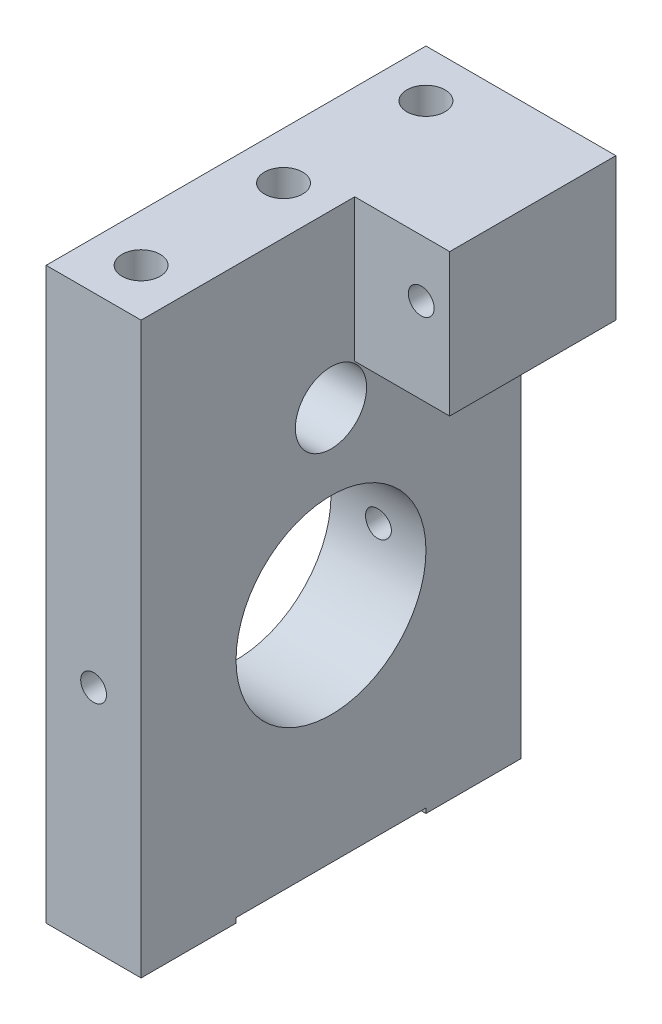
from build123d import *

# Parameters (mm, degrees)
SKETCH1_W                   = 50.8
SKETCH1_H                   = 76.2
BOSS_EXTRUDE1_DEPTH         = 6.35
SKETCH2_W                   = 22.225
SKETCH2_H                   = 19.05
BOSS_EXTRUDE2_DEPTH         = 12.7
F_1_4_20_TAPPED_HOLE1_D     = 5.1054
F_1_4_20_TAPPED_HOLE1_DEPTH = 19.05
F_1_4_20_TAPPED_HOLE1_TIP   = 1.533816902
CUT_EXTRUDE1_REACH          = 49.519
SKETCH5_W                   = 25.4
SKETCH5_H                   = 0.635
F_1_4_20_TAPPED_HOLE2_D     = 5.1054
F_1_4_20_TAPPED_HOLE2_DEPTH = 19.05
F_1_4_20_TAPPED_HOLE2_TIP   = 1.533816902
CUT_EXTRUDE2_REACH          = 49.519
SKETCH8_R                   = 12.7
F_8_32_TAPPED_HOLE1_D       = 3.4544
SKETCH11_R                  = 4.7625
CUT_EXTRUDE3_DEPTH          = 53.363441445
F_8_32_TAPPED_HOLE2_D       = 3.4544


with BuildPart() as part:
    # Sketch1 → Boss-Extrude1 (new, symmetric)
    with BuildSketch(Plane(origin=(0, 0, 0), x_dir=(0, 0, -1), z_dir=(1, 0, 0))):
        Rectangle(SKETCH1_W, SKETCH1_H)
    extrude(amount=BOSS_EXTRUDE1_DEPTH, both=True)

    # Sketch2 → Boss-Extrude2 (add)
    with BuildSketch(Plane(origin=(6.35, 0, 0), x_dir=(0, 0, -1), z_dir=(1, 0, 0))):
        with Locations((14.2875, 28.575)):
            Rectangle(SKETCH2_W, SKETCH2_H)
    extrude(amount=BOSS_EXTRUDE2_DEPTH)

    # 1_4-20 Tapped Hole1
    with Locations(Plane(origin=(0, -38.1, 0), x_dir=(-1, 0, 0), z_dir=(0, -1, 0))):
        with Locations((0, -19.05), (0, 19.05)):
            Hole(F_1_4_20_TAPPED_HOLE1_D / 2, depth=F_1_4_20_TAPPED_HOLE1_DEPTH)
            with Locations((0, 0, -(F_1_4_20_TAPPED_HOLE1_DEPTH + F_1_4_20_TAPPED_HOLE1_TIP / 2))):  # 118° drill point
                Cone(0, F_1_4_20_TAPPED_HOLE1_D / 2, F_1_4_20_TAPPED_HOLE1_TIP, mode=Mode.SUBTRACT)

    # Sketch5 → Cut-Extrude1 (cut, up to next)
    with BuildSketch(Plane(origin=(6.35, 0, 0), x_dir=(0, 0, -1), z_dir=(1, 0, 0)), mode=Mode.PRIVATE) as cut_extrude1_sk1:
        with Locations((0, -37.7825)):
            Rectangle(SKETCH5_W, SKETCH5_H)
    cut_extrude1_tool1 = extrude(cut_extrude1_sk1.sketch, amount=-CUT_EXTRUDE1_REACH, mode=Mode.PRIVATE) & part.part
    add(cut_extrude1_tool1.solids().sort_by_distance((6.35, -37.7825, 0))[0], mode=Mode.SUBTRACT)

    # 1_4-20 Tapped Hole2
    with Locations(Plane(origin=(0, 38.1, 0), x_dir=(1, 0, 0), z_dir=(0, 1, 0))):
        with Locations((0, 19.05), (0, 0), (0, -19.05)):
            Hole(F_1_4_20_TAPPED_HOLE2_D / 2, depth=F_1_4_20_TAPPED_HOLE2_DEPTH)
            with Locations((0, 0, -(F_1_4_20_TAPPED_HOLE2_DEPTH + F_1_4_20_TAPPED_HOLE2_TIP / 2))):  # 118° drill point
                Cone(0, F_1_4_20_TAPPED_HOLE2_D / 2, F_1_4_20_TAPPED_HOLE2_TIP, mode=Mode.SUBTRACT)

    # Sketch8 → Cut-Extrude2 (cut, up to next)
    with BuildSketch(Plane(origin=(6.35, 0, 0), x_dir=(0, 0, -1), z_dir=(1, 0, 0)), mode=Mode.PRIVATE) as cut_extrude2_sk1:
        with Locations((0, -7.62)):
            Circle(SKETCH8_R)
    cut_extrude2_tool1 = extrude(cut_extrude2_sk1.sketch, amount=-CUT_EXTRUDE2_REACH, mode=Mode.PRIVATE) & part.part
    add(cut_extrude2_tool1.solids().sort_by_distance((6.35, -7.62, 0))[0], mode=Mode.SUBTRACT)

    # 8-32 Tapped Hole1 (through all)
    with Locations(Plane.XY.offset(-3.175)):
        with Locations((15.24, 30.48)):
            Hole(F_8_32_TAPPED_HOLE1_D / 2)

    # Sketch11 → Cut-Extrude3 (cut, through all)
    with BuildSketch(Plane.ZY.offset(6.35)):
        with Locations((0, 15.24)):
            Circle(SKETCH11_R)
    extrude(amount=-CUT_EXTRUDE3_DEPTH, mode=Mode.SUBTRACT)

    # 8-32 Tapped Hole2 (through all)
    with Locations(Plane.XY.offset(25.4)):
        with Locations((0, -7.62)):
            Hole(F_8_32_TAPPED_HOLE2_D / 2)


solid = part.part
